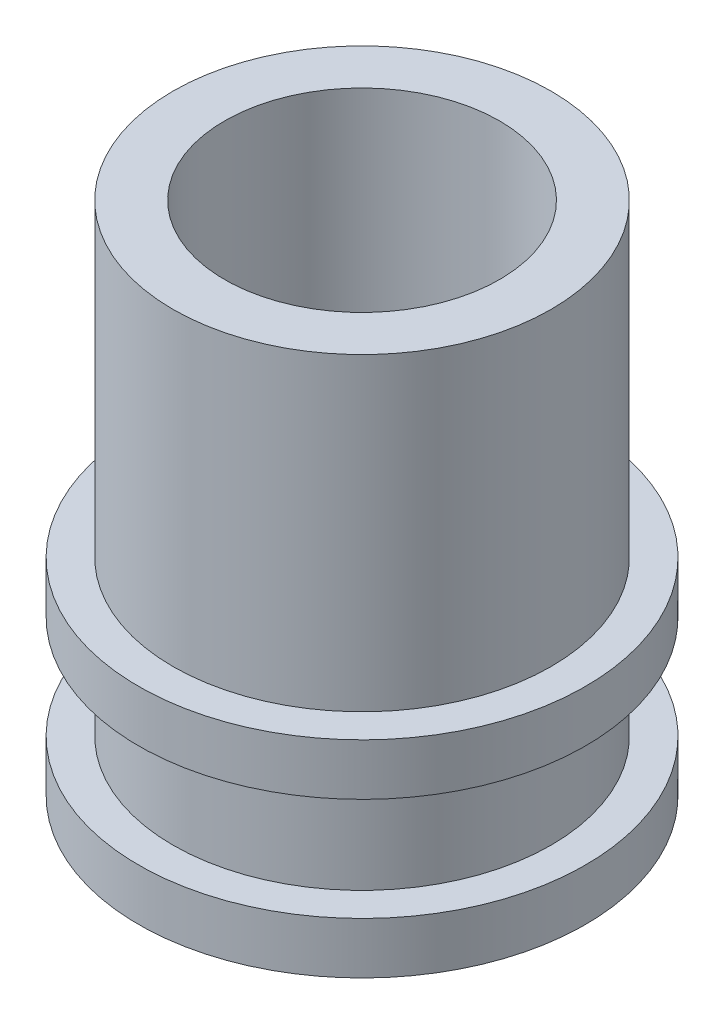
ISO-10303-21;
HEADER;
FILE_DESCRIPTION(('STEP AP214'),'2;1');
FILE_NAME('part.step','',(''),(''),'','','');
FILE_SCHEMA(('AUTOMOTIVE_DESIGN { 1 0 10303 214 1 1 1 1 }'));
ENDSEC;
DATA;
#1=APPLICATION_CONTEXT('core data for automotive mechanical design processes');
#2=APPLICATION_PROTOCOL_DEFINITION('international standard','automotive_design',2000,#1);
#3=PRODUCT_CONTEXT('',#1,'mechanical');
#4=PRODUCT('Part','Part','',(#3));
#5=PRODUCT_RELATED_PRODUCT_CATEGORY('part','',(#4));
#6=PRODUCT_DEFINITION_FORMATION('','',#4);
#7=PRODUCT_DEFINITION_CONTEXT('part definition',#1,'design');
#8=PRODUCT_DEFINITION('design','',#6,#7);
#9=PRODUCT_DEFINITION_SHAPE('','',#8);
#10=(LENGTH_UNIT() NAMED_UNIT(*) SI_UNIT(.MILLI.,.METRE.));
#11=(NAMED_UNIT(*) PLANE_ANGLE_UNIT() SI_UNIT($,.RADIAN.));
#12=(NAMED_UNIT(*) SI_UNIT($,.STERADIAN.) SOLID_ANGLE_UNIT());
#13=UNCERTAINTY_MEASURE_WITH_UNIT(LENGTH_MEASURE(1.E-05),#10,'distance_accuracy_value','');
#14=(GEOMETRIC_REPRESENTATION_CONTEXT(3) GLOBAL_UNCERTAINTY_ASSIGNED_CONTEXT((#13)) GLOBAL_UNIT_ASSIGNED_CONTEXT((#10,
#11,#12)) REPRESENTATION_CONTEXT('',''));
#15=CARTESIAN_POINT('',(0.,0.,0.));
#16=DIRECTION('',(0.,0.,1.));
#17=DIRECTION('',(1.,0.,0.));
#18=AXIS2_PLACEMENT_3D('',#15,#16,#17);
#19=CARTESIAN_POINT('',(-5.5,15.,0.));
#20=DIRECTION('',(0.,-1.,0.));
#21=DIRECTION('',(0.,0.,-1.));
#22=AXIS2_PLACEMENT_3D('',#19,#20,#21);
#23=PLANE('',#22);
#24=CARTESIAN_POINT('',(0.,15.,0.));
#25=DIRECTION('',(0.,-1.,0.));
#26=DIRECTION('',(0.,0.,-1.));
#27=AXIS2_PLACEMENT_3D('',#24,#25,#26);
#28=CIRCLE('',#27,5.5);
#29=CARTESIAN_POINT('',(0.,15.,-5.5));
#30=VERTEX_POINT('',#29);
#31=EDGE_CURVE('E10',#30,#30,#28,.T.);
#32=ORIENTED_EDGE('',*,*,#31,.F.);
#33=EDGE_LOOP('',(#32));
#34=FACE_BOUND('',#33,.T.);
#35=CARTESIAN_POINT('',(0.,15.,0.));
#36=DIRECTION('',(0.,-1.,0.));
#37=DIRECTION('',(0.,0.,-1.));
#38=AXIS2_PLACEMENT_3D('',#35,#36,#37);
#39=CIRCLE('',#38,4.);
#40=CARTESIAN_POINT('',(0.,15.,-4.));
#41=VERTEX_POINT('',#40);
#42=EDGE_CURVE('E62',#41,#41,#39,.T.);
#43=ORIENTED_EDGE('',*,*,#42,.T.);
#44=EDGE_LOOP('',(#43));
#45=FACE_BOUND('',#44,.T.);
#46=ADVANCED_FACE('F28',(#34,#45),#23,.F.);
#47=CARTESIAN_POINT('',(0.,0.,0.));
#48=DIRECTION('',(0.,-1.,0.));
#49=DIRECTION('',(0.,0.,-1.));
#50=AXIS2_PLACEMENT_3D('',#47,#48,#49);
#51=CYLINDRICAL_SURFACE('',#50,5.5);
#52=CARTESIAN_POINT('',(0.,6.,0.));
#53=DIRECTION('',(0.,-1.,0.));
#54=DIRECTION('',(0.,0.,-1.));
#55=AXIS2_PLACEMENT_3D('',#52,#53,#54);
#56=CIRCLE('',#55,5.5);
#57=CARTESIAN_POINT('',(0.,6.,-5.5));
#58=VERTEX_POINT('',#57);
#59=EDGE_CURVE('E34',#58,#58,#56,.T.);
#60=ORIENTED_EDGE('',*,*,#59,.F.);
#61=EDGE_LOOP('',(#60));
#62=FACE_BOUND('',#61,.T.);
#63=ORIENTED_EDGE('',*,*,#31,.T.);
#64=EDGE_LOOP('',(#63));
#65=FACE_BOUND('',#64,.T.);
#66=ADVANCED_FACE('F111',(#62,#65),#51,.T.);
#67=CARTESIAN_POINT('',(-6.5,6.,0.));
#68=DIRECTION('',(0.,-1.,0.));
#69=DIRECTION('',(0.,0.,-1.));
#70=AXIS2_PLACEMENT_3D('',#67,#68,#69);
#71=PLANE('',#70);
#72=CARTESIAN_POINT('',(0.,6.,0.));
#73=DIRECTION('',(0.,-1.,0.));
#74=DIRECTION('',(0.,0.,-1.));
#75=AXIS2_PLACEMENT_3D('',#72,#73,#74);
#76=CIRCLE('',#75,6.5);
#77=CARTESIAN_POINT('',(0.,6.,-6.5));
#78=VERTEX_POINT('',#77);
#79=EDGE_CURVE('E38',#78,#78,#76,.T.);
#80=ORIENTED_EDGE('',*,*,#79,.F.);
#81=EDGE_LOOP('',(#80));
#82=FACE_BOUND('',#81,.T.);
#83=ORIENTED_EDGE('',*,*,#59,.T.);
#84=EDGE_LOOP('',(#83));
#85=FACE_BOUND('',#84,.T.);
#86=ADVANCED_FACE('F106',(#82,#85),#71,.F.);
#87=CARTESIAN_POINT('',(0.,0.,0.));
#88=DIRECTION('',(0.,-1.,0.));
#89=DIRECTION('',(0.,0.,-1.));
#90=AXIS2_PLACEMENT_3D('',#87,#88,#89);
#91=CYLINDRICAL_SURFACE('',#90,6.5);
#92=CARTESIAN_POINT('',(0.,4.5,0.));
#93=DIRECTION('',(0.,-1.,0.));
#94=DIRECTION('',(0.,0.,-1.));
#95=AXIS2_PLACEMENT_3D('',#92,#93,#94);
#96=CIRCLE('',#95,6.5);
#97=CARTESIAN_POINT('',(0.,4.5,-6.5));
#98=VERTEX_POINT('',#97);
#99=EDGE_CURVE('E42',#98,#98,#96,.T.);
#100=ORIENTED_EDGE('',*,*,#99,.F.);
#101=EDGE_LOOP('',(#100));
#102=FACE_BOUND('',#101,.T.);
#103=ORIENTED_EDGE('',*,*,#79,.T.);
#104=EDGE_LOOP('',(#103));
#105=FACE_BOUND('',#104,.T.);
#106=ADVANCED_FACE('F100',(#102,#105),#91,.T.);
#107=CARTESIAN_POINT('',(-5.5,4.5,0.));
#108=DIRECTION('',(0.,1.,0.));
#109=DIRECTION('',(0.,0.,1.));
#110=AXIS2_PLACEMENT_3D('',#107,#108,#109);
#111=PLANE('',#110);
#112=CARTESIAN_POINT('',(0.,4.5,0.));
#113=DIRECTION('',(0.,-1.,0.));
#114=DIRECTION('',(0.,0.,-1.));
#115=AXIS2_PLACEMENT_3D('',#112,#113,#114);
#116=CIRCLE('',#115,5.5);
#117=CARTESIAN_POINT('',(0.,4.5,-5.5));
#118=VERTEX_POINT('',#117);
#119=EDGE_CURVE('E47',#118,#118,#116,.T.);
#120=ORIENTED_EDGE('',*,*,#119,.F.);
#121=EDGE_LOOP('',(#120));
#122=FACE_BOUND('',#121,.T.);
#123=ORIENTED_EDGE('',*,*,#99,.T.);
#124=EDGE_LOOP('',(#123));
#125=FACE_BOUND('',#124,.T.);
#126=ADVANCED_FACE('F94',(#122,#125),#111,.F.);
#127=CARTESIAN_POINT('',(0.,0.,0.));
#128=DIRECTION('',(0.,-1.,0.));
#129=DIRECTION('',(0.,0.,-1.));
#130=AXIS2_PLACEMENT_3D('',#127,#128,#129);
#131=CYLINDRICAL_SURFACE('',#130,5.5);
#132=CARTESIAN_POINT('',(0.,1.5,0.));
#133=DIRECTION('',(0.,-1.,0.));
#134=DIRECTION('',(0.,0.,-1.));
#135=AXIS2_PLACEMENT_3D('',#132,#133,#134);
#136=CIRCLE('',#135,5.5);
#137=CARTESIAN_POINT('',(0.,1.5,-5.5));
#138=VERTEX_POINT('',#137);
#139=EDGE_CURVE('E50',#138,#138,#136,.T.);
#140=ORIENTED_EDGE('',*,*,#139,.F.);
#141=EDGE_LOOP('',(#140));
#142=FACE_BOUND('',#141,.T.);
#143=ORIENTED_EDGE('',*,*,#119,.T.);
#144=EDGE_LOOP('',(#143));
#145=FACE_BOUND('',#144,.T.);
#146=ADVANCED_FACE('F88',(#142,#145),#131,.T.);
#147=CARTESIAN_POINT('',(-6.5,1.5,0.));
#148=DIRECTION('',(0.,-1.,0.));
#149=DIRECTION('',(0.,0.,-1.));
#150=AXIS2_PLACEMENT_3D('',#147,#148,#149);
#151=PLANE('',#150);
#152=CARTESIAN_POINT('',(0.,1.5,0.));
#153=DIRECTION('',(0.,-1.,0.));
#154=DIRECTION('',(0.,0.,-1.));
#155=AXIS2_PLACEMENT_3D('',#152,#153,#154);
#156=CIRCLE('',#155,6.5);
#157=CARTESIAN_POINT('',(0.,1.5,-6.5));
#158=VERTEX_POINT('',#157);
#159=EDGE_CURVE('E53',#158,#158,#156,.T.);
#160=ORIENTED_EDGE('',*,*,#159,.F.);
#161=EDGE_LOOP('',(#160));
#162=FACE_BOUND('',#161,.T.);
#163=ORIENTED_EDGE('',*,*,#139,.T.);
#164=EDGE_LOOP('',(#163));
#165=FACE_BOUND('',#164,.T.);
#166=ADVANCED_FACE('F82',(#162,#165),#151,.F.);
#167=CARTESIAN_POINT('',(0.,0.,0.));
#168=DIRECTION('',(0.,-1.,0.));
#169=DIRECTION('',(0.,0.,-1.));
#170=AXIS2_PLACEMENT_3D('',#167,#168,#169);
#171=CYLINDRICAL_SURFACE('',#170,6.5);
#172=CARTESIAN_POINT('',(0.,0.,0.));
#173=DIRECTION('',(0.,-1.,0.));
#174=DIRECTION('',(0.,0.,-1.));
#175=AXIS2_PLACEMENT_3D('',#172,#173,#174);
#176=CIRCLE('',#175,6.5);
#177=CARTESIAN_POINT('',(0.,0.,-6.5));
#178=VERTEX_POINT('',#177);
#179=EDGE_CURVE('E56',#178,#178,#176,.T.);
#180=ORIENTED_EDGE('',*,*,#179,.F.);
#181=EDGE_LOOP('',(#180));
#182=FACE_BOUND('',#181,.T.);
#183=ORIENTED_EDGE('',*,*,#159,.T.);
#184=EDGE_LOOP('',(#183));
#185=FACE_BOUND('',#184,.T.);
#186=ADVANCED_FACE('F76',(#182,#185),#171,.T.);
#187=CARTESIAN_POINT('',(-4.,0.,0.));
#188=DIRECTION('',(0.,1.,0.));
#189=DIRECTION('',(0.,0.,1.));
#190=AXIS2_PLACEMENT_3D('',#187,#188,#189);
#191=PLANE('',#190);
#192=CARTESIAN_POINT('',(0.,0.,0.));
#193=DIRECTION('',(0.,-1.,0.));
#194=DIRECTION('',(0.,0.,-1.));
#195=AXIS2_PLACEMENT_3D('',#192,#193,#194);
#196=CIRCLE('',#195,4.);
#197=CARTESIAN_POINT('',(0.,0.,-4.));
#198=VERTEX_POINT('',#197);
#199=EDGE_CURVE('E59',#198,#198,#196,.T.);
#200=ORIENTED_EDGE('',*,*,#199,.F.);
#201=EDGE_LOOP('',(#200));
#202=FACE_BOUND('',#201,.T.);
#203=ORIENTED_EDGE('',*,*,#179,.T.);
#204=EDGE_LOOP('',(#203));
#205=FACE_BOUND('',#204,.T.);
#206=ADVANCED_FACE('F70',(#202,#205),#191,.F.);
#207=CARTESIAN_POINT('',(0.,0.,0.));
#208=DIRECTION('',(0.,-1.,0.));
#209=DIRECTION('',(0.,0.,-1.));
#210=AXIS2_PLACEMENT_3D('',#207,#208,#209);
#211=CYLINDRICAL_SURFACE('',#210,4.);
#212=ORIENTED_EDGE('',*,*,#42,.F.);
#213=EDGE_LOOP('',(#212));
#214=FACE_BOUND('',#213,.T.);
#215=ORIENTED_EDGE('',*,*,#199,.T.);
#216=EDGE_LOOP('',(#215));
#217=FACE_BOUND('',#216,.T.);
#218=ADVANCED_FACE('F67',(#214,#217),#211,.F.);
#219=CLOSED_SHELL('',(#46,#66,#86,#106,#126,#146,#166,#186,#206,#218));
#220=MANIFOLD_SOLID_BREP('B2',#219);
#221=ADVANCED_BREP_SHAPE_REPRESENTATION('',(#18,#220),#14);
#222=SHAPE_DEFINITION_REPRESENTATION(#9,#221);
ENDSEC;
END-ISO-10303-21;
